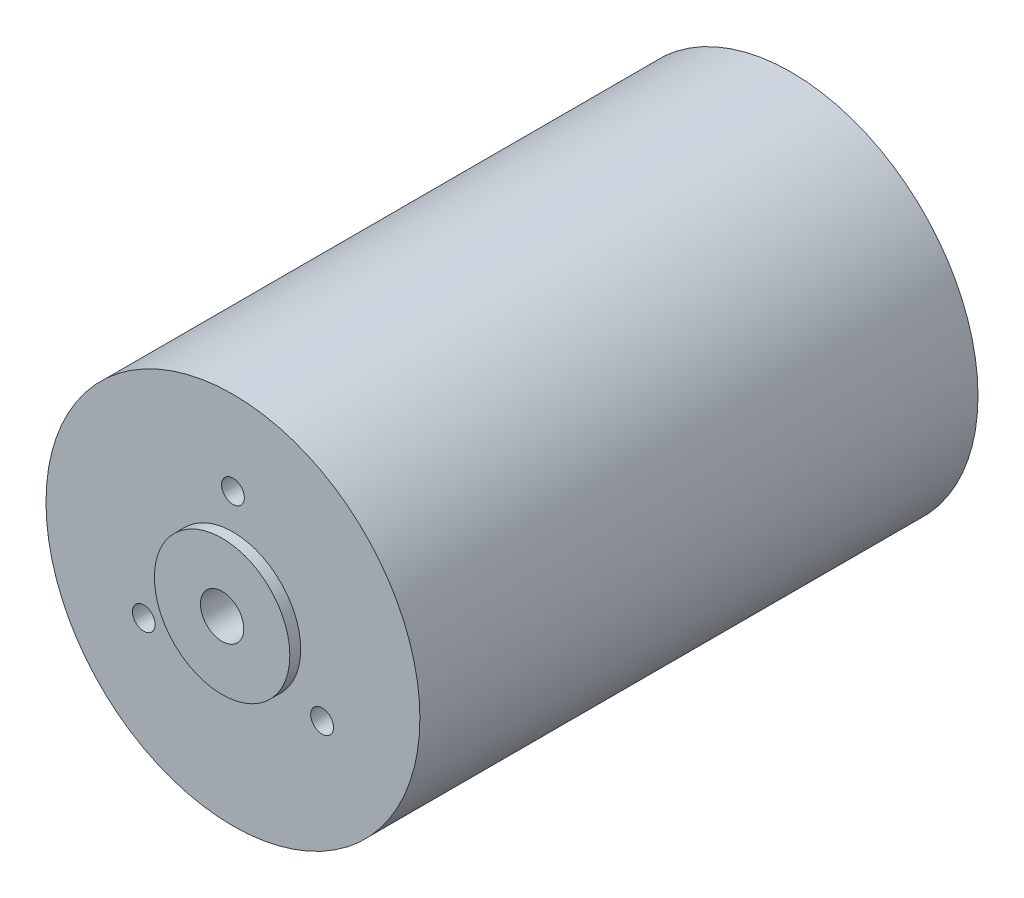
from build123d import *

# Parameters (mm, degrees)
ESQUISSE1_R                  = 34.5
EXTRUSION1_DEPTH             = 103
ESQUISSE2_R                  = 14
EXTRUSION2_DEPTH             = 8
ESQUISSE4_R                  = 12.5
EXTRUSION3_DEPTH             = 2
ESQUISSE5_R                  = 4
ENL_V_MAT_EXTRU_1_DEPTH      = 13.5
R_P_TITION_CIRCULAIRE1_COUNT = 3


with BuildPart() as part:
    # Esquisse1 → Extrusion1 (new body)
    with BuildSketch(Plane.XY):
        Circle(ESQUISSE1_R)
    extrude(amount=EXTRUSION1_DEPTH)

    # Esquisse2 → Extrusion2 (add)
    with BuildSketch(Plane(origin=(0, 0, 0), x_dir=(-1, 0, 0), z_dir=(0, 0, -1))):
        with Locations(Location((0, 0, 0), (0, 0, 180))):
            Circle(ESQUISSE2_R)
    extrude(amount=EXTRUSION2_DEPTH)

    # Esquisse4 → Extrusion3 (add)
    with BuildSketch(Plane.XY.offset(103)):
        Circle(ESQUISSE4_R)
    extrude(amount=EXTRUSION3_DEPTH)

    # Esquisse5 → Enl_v. mat.-Extru.1 (cut)
    with BuildSketch(Plane.XY.offset(105)):
        Circle(ESQUISSE5_R)
    extrude(amount=-ENL_V_MAT_EXTRU_1_DEPTH, mode=Mode.SUBTRACT)

    # Esquisse6 → Trou taraud_ M51 (revolve, cut)
    with BuildSketch(Plane(origin=(0, 19, 103), x_dir=(0, -1, 0), z_dir=(1, 0, 0))):
        Polygon((0, 0), (0, 15.2618073), (2.1, 14), (2.1, 0), align=None)
    trou_taraud_m51 = revolve(axis=Axis((0, 19, 109.35), (0, 0, -1)), mode=Mode.SUBTRACT)

    # R_p_tition circulaire1: Trou taraud_ M51 ×3 about axis
    r_p_tition_circulaire1_axis = Axis((0, 0, 0), (0, 0, 1))
    for i in range(1, R_P_TITION_CIRCULAIRE1_COUNT):
        add(trou_taraud_m51.rotate(r_p_tition_circulaire1_axis, i * 360 / R_P_TITION_CIRCULAIRE1_COUNT), mode=Mode.SUBTRACT)


solid = part.part
